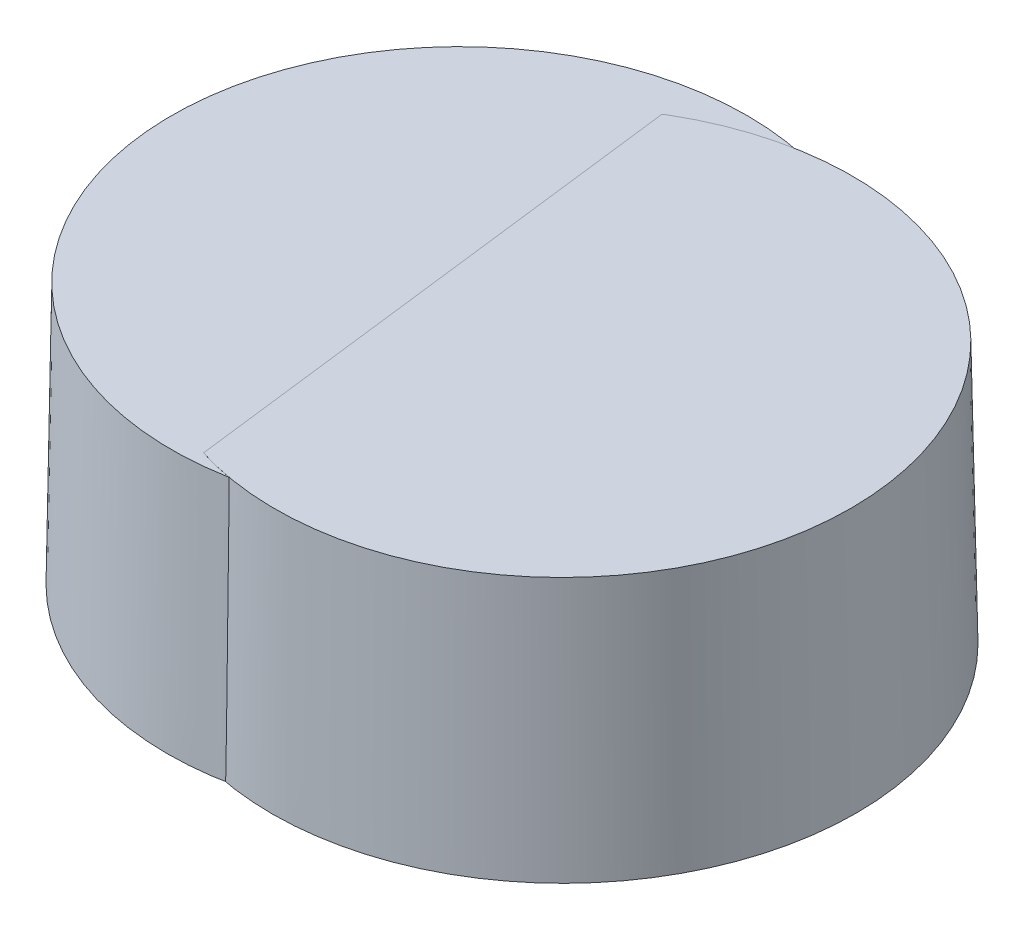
ISO-10303-21;
HEADER;
FILE_DESCRIPTION(('STEP AP214'),'2;1');
FILE_NAME('part.step','',(''),(''),'','','');
FILE_SCHEMA(('AUTOMOTIVE_DESIGN { 1 0 10303 214 1 1 1 1 }'));
ENDSEC;
DATA;
#1=APPLICATION_CONTEXT('core data for automotive mechanical design processes');
#2=APPLICATION_PROTOCOL_DEFINITION('international standard','automotive_design',2000,#1);
#3=PRODUCT_CONTEXT('',#1,'mechanical');
#4=PRODUCT('Part','Part','',(#3));
#5=PRODUCT_RELATED_PRODUCT_CATEGORY('part','',(#4));
#6=PRODUCT_DEFINITION_FORMATION('','',#4);
#7=PRODUCT_DEFINITION_CONTEXT('part definition',#1,'design');
#8=PRODUCT_DEFINITION('design','',#6,#7);
#9=PRODUCT_DEFINITION_SHAPE('','',#8);
#10=(LENGTH_UNIT() NAMED_UNIT(*) SI_UNIT(.MILLI.,.METRE.));
#11=(NAMED_UNIT(*) PLANE_ANGLE_UNIT() SI_UNIT($,.RADIAN.));
#12=(NAMED_UNIT(*) SI_UNIT($,.STERADIAN.) SOLID_ANGLE_UNIT());
#13=UNCERTAINTY_MEASURE_WITH_UNIT(LENGTH_MEASURE(1.E-05),#10,'distance_accuracy_value','');
#14=(GEOMETRIC_REPRESENTATION_CONTEXT(3) GLOBAL_UNCERTAINTY_ASSIGNED_CONTEXT((#13)) GLOBAL_UNIT_ASSIGNED_CONTEXT((#10,
#11,#12)) REPRESENTATION_CONTEXT('',''));
#15=CARTESIAN_POINT('',(0.,0.,0.));
#16=DIRECTION('',(0.,0.,1.));
#17=DIRECTION('',(1.,0.,0.));
#18=AXIS2_PLACEMENT_3D('',#15,#16,#17);
#19=CARTESIAN_POINT('',(26.6198878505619,22.457576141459,7.04595255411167));
#20=DIRECTION('',(0.00103387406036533,0.999998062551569,0.00167511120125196));
#21=DIRECTION('',(-0.525214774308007,0.00196847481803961,-0.850967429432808));
#22=AXIS2_PLACEMENT_3D('',#19,#20,#21);
#23=PLANE('',#22);
#24=CARTESIAN_POINT('',(-3.99909832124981,22.501050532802,-0.00917998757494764));
#25=DIRECTION('',(-0.00103387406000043,-0.999998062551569,-0.00167511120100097));
#26=DIRECTION('',(0.,0.00167511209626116,-0.999998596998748));
#27=AXIS2_PLACEMENT_3D('',#24,#25,#26);
#28=CIRCLE('',#27,22.0853174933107);
#29=CARTESIAN_POINT('',(-3.99909832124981,22.5380459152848,-22.0944664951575));
#30=VERTEX_POINT('',#29);
#31=EDGE_CURVE('P0_E19',#30,#30,#28,.T.);
#32=ORIENTED_EDGE('',*,*,#31,.F.);
#33=EDGE_LOOP('',(#32));
#34=FACE_BOUND('',#33,.T.);
#35=ADVANCED_FACE('P0_F15',(#34),#23,.T.);
#36=CARTESIAN_POINT('',(3.50742576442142,2.485756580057,-31.0171490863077));
#37=DIRECTION('',(-0.00103387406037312,-0.999998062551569,-0.00167511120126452));
#38=DIRECTION('',(0.525214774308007,-0.00196847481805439,0.850967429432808));
#39=AXIS2_PLACEMENT_3D('',#36,#37,#38);
#40=PLANE('',#39);
#41=CARTESIAN_POINT('',(-4.01983725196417,2.4416532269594,-0.0427817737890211));
#42=DIRECTION('',(-0.00103387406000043,-0.999998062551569,-0.00167511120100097));
#43=DIRECTION('',(0.,0.00167511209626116,-0.999998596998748));
#44=AXIS2_PLACEMENT_3D('',#41,#42,#43);
#45=CIRCLE('',#44,22.4048348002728);
#46=CARTESIAN_POINT('',(-4.01983725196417,2.47918383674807,-22.4475851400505));
#47=VERTEX_POINT('',#46);
#48=EDGE_CURVE('P0_E10',#47,#47,#45,.F.);
#49=ORIENTED_EDGE('',*,*,#48,.F.);
#50=EDGE_LOOP('',(#49));
#51=FACE_BOUND('',#50,.T.);
#52=ADVANCED_FACE('P0_F30',(#51),#40,.T.);
#53=CARTESIAN_POINT('',(-4.01983725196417,2.44165322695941,-0.0427817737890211));
#54=DIRECTION('',(-0.00103387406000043,-0.999998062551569,-0.00167511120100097));
#55=DIRECTION('',(0.,0.00167511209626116,-0.999998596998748));
#56=AXIS2_PLACEMENT_3D('',#53,#54,#55);
#57=CONICAL_SURFACE('',#56,22.4048348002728,0.0159271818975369);
#58=ORIENTED_EDGE('',*,*,#31,.T.);
#59=EDGE_LOOP('',(#58));
#60=FACE_BOUND('',#59,.T.);
#61=ORIENTED_EDGE('',*,*,#48,.T.);
#62=EDGE_LOOP('',(#61));
#63=FACE_BOUND('',#62,.T.);
#64=ADVANCED_FACE('P0_F17',(#60,#63),#57,.T.);
#65=CLOSED_SHELL('',(#35,#52,#64));
#66=MANIFOLD_SOLID_BREP('P0_B1',#65);
#67=CARTESIAN_POINT('',(2.12822923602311,22.45387407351,31.3316605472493));
#68=DIRECTION('',(-0.00238360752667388,0.999994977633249,0.00208880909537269));
#69=DIRECTION('',(0.752079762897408,0.00316933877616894,-0.659064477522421));
#70=AXIS2_PLACEMENT_3D('',#67,#68,#69);
#71=PLANE('',#70);
#72=CARTESIAN_POINT('',(4.00644526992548,22.523821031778,-0.0114034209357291));
#73=DIRECTION('',(0.00238360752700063,-0.999994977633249,-0.0020888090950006));
#74=DIRECTION('',(0.999997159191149,0.00238361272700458,0.));
#75=AXIS2_PLACEMENT_3D('',#72,#73,#74);
#76=CIRCLE('',#75,22.0698900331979);
#77=CARTESIAN_POINT('',(26.0762726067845,22.5764271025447,-0.0114034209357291));
#78=VERTEX_POINT('',#77);
#79=EDGE_CURVE('P1_E18',#78,#78,#76,.T.);
#80=ORIENTED_EDGE('',*,*,#79,.F.);
#81=EDGE_LOOP('',(#80));
#82=FACE_BOUND('',#81,.T.);
#83=ADVANCED_FACE('P1_F14',(#82),#71,.T.);
#84=CARTESIAN_POINT('',(35.8307012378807,2.522027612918,2.23170511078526));
#85=DIRECTION('',(0.00238360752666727,-0.999994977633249,-0.00208880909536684));
#86=DIRECTION('',(-0.752079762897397,-0.00316933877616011,0.659064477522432));
#87=AXIS2_PLACEMENT_3D('',#84,#85,#86);
#88=PLANE('',#87);
#89=CARTESIAN_POINT('',(4.05429109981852,2.4510577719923,-0.0533318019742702));
#90=DIRECTION('',(0.00238360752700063,-0.999994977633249,-0.0020888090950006));
#91=DIRECTION('',(0.999997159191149,0.00238361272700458,0.));
#92=AXIS2_PLACEMENT_3D('',#89,#90,#91);
#93=CIRCLE('',#92,22.3926332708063);
#94=CARTESIAN_POINT('',(26.446860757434,2.50443313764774,-0.0533318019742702));
#95=VERTEX_POINT('',#94);
#96=EDGE_CURVE('P1_E9',#95,#95,#93,.F.);
#97=ORIENTED_EDGE('',*,*,#96,.F.);
#98=EDGE_LOOP('',(#97));
#99=FACE_BOUND('',#98,.T.);
#100=ADVANCED_FACE('P1_F29',(#99),#88,.T.);
#101=CARTESIAN_POINT('',(4.05429109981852,2.45105777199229,-0.0533318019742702));
#102=DIRECTION('',(0.00238360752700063,-0.999994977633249,-0.0020888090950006));
#103=DIRECTION('',(0.999997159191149,0.00238361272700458,0.));
#104=AXIS2_PLACEMENT_3D('',#101,#102,#103);
#105=CONICAL_SURFACE('',#104,22.3926332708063,0.0160771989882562);
#106=ORIENTED_EDGE('',*,*,#79,.T.);
#107=EDGE_LOOP('',(#106));
#108=FACE_BOUND('',#107,.T.);
#109=ORIENTED_EDGE('',*,*,#96,.T.);
#110=EDGE_LOOP('',(#109));
#111=FACE_BOUND('',#110,.T.);
#112=ADVANCED_FACE('P1_F16',(#108,#111),#105,.T.);
#113=CLOSED_SHELL('',(#83,#100,#112));
#114=MANIFOLD_SOLID_BREP('P1_B1',#113);
#115=ADVANCED_BREP_SHAPE_REPRESENTATION('',(#18,#66,#114),#14);
#116=SHAPE_DEFINITION_REPRESENTATION(#9,#115);
ENDSEC;
END-ISO-10303-21;
